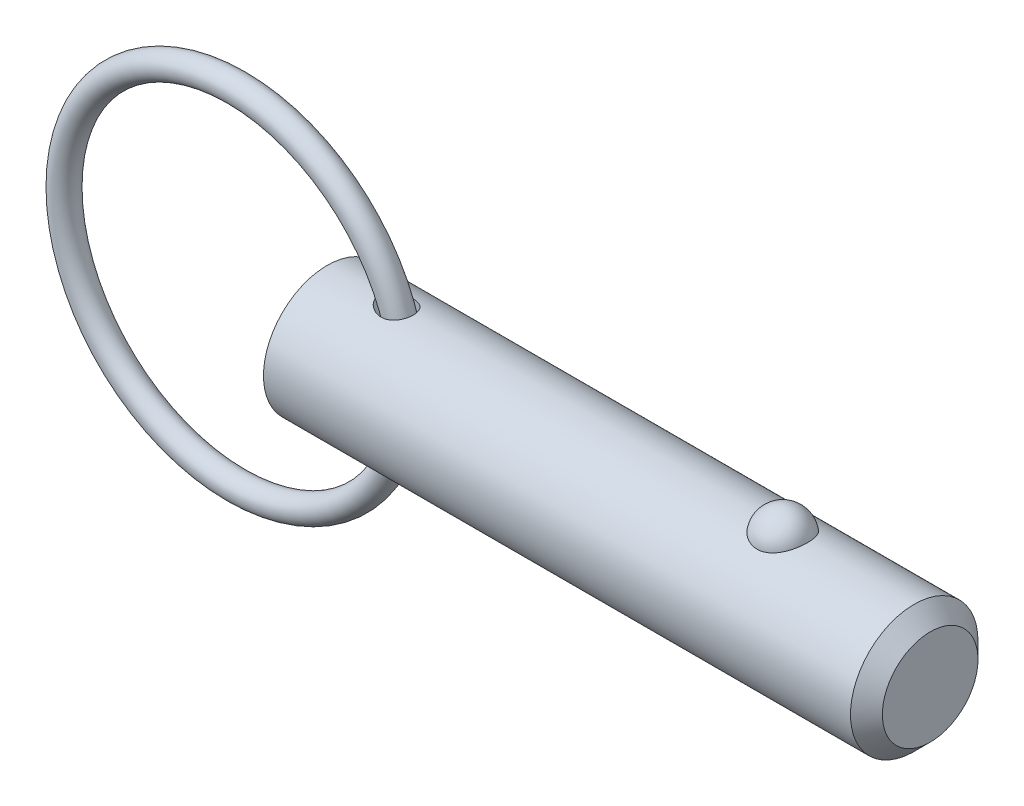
ISO-10303-21;
HEADER;
FILE_DESCRIPTION(('STEP AP214'),'2;1');
FILE_NAME('part.step','',(''),(''),'','','');
FILE_SCHEMA(('AUTOMOTIVE_DESIGN { 1 0 10303 214 1 1 1 1 }'));
ENDSEC;
DATA;
#1=APPLICATION_CONTEXT('core data for automotive mechanical design processes');
#2=APPLICATION_PROTOCOL_DEFINITION('international standard','automotive_design',2000,#1);
#3=PRODUCT_CONTEXT('',#1,'mechanical');
#4=PRODUCT('Part','Part','',(#3));
#5=PRODUCT_RELATED_PRODUCT_CATEGORY('part','',(#4));
#6=PRODUCT_DEFINITION_FORMATION('','',#4);
#7=PRODUCT_DEFINITION_CONTEXT('part definition',#1,'design');
#8=PRODUCT_DEFINITION('design','',#6,#7);
#9=PRODUCT_DEFINITION_SHAPE('','',#8);
#10=(LENGTH_UNIT() NAMED_UNIT(*) SI_UNIT(.MILLI.,.METRE.));
#11=(NAMED_UNIT(*) PLANE_ANGLE_UNIT() SI_UNIT($,.RADIAN.));
#12=(NAMED_UNIT(*) SI_UNIT($,.STERADIAN.) SOLID_ANGLE_UNIT());
#13=UNCERTAINTY_MEASURE_WITH_UNIT(LENGTH_MEASURE(1.E-05),#10,'distance_accuracy_value','');
#14=(GEOMETRIC_REPRESENTATION_CONTEXT(3) GLOBAL_UNCERTAINTY_ASSIGNED_CONTEXT((#13)) GLOBAL_UNIT_ASSIGNED_CONTEXT((#10,
#11,#12)) REPRESENTATION_CONTEXT('',''));
#15=CARTESIAN_POINT('',(0.,0.,0.));
#16=DIRECTION('',(0.,0.,1.));
#17=DIRECTION('',(1.,0.,0.));
#18=AXIS2_PLACEMENT_3D('',#15,#16,#17);
#19=CARTESIAN_POINT('',(-6.70471658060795,0.,0.));
#20=DIRECTION('',(0.,0.,1.));
#21=DIRECTION('',(1.,0.,0.));
#22=AXIS2_PLACEMENT_3D('',#19,#20,#21);
#23=TOROIDAL_SURFACE('',#22,12.7,0.940000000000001);
#24=CARTESIAN_POINT('',(6.93528341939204,0.,0.));
#25=VERTEX_POINT('',#24);
#26=VERTEX_LOOP('',#25);
#27=FACE_BOUND('',#26,.T.);
#28=ADVANCED_FACE('P0_F12',(#27),#23,.T.);
#29=CLOSED_SHELL('',(#28));
#30=MANIFOLD_SOLID_BREP('P0_B1',#29);
#31=CARTESIAN_POINT('',(0.,0.,0.));
#32=DIRECTION('',(1.,0.,0.));
#33=DIRECTION('',(0.,0.,-1.));
#34=AXIS2_PLACEMENT_3D('',#31,#32,#33);
#35=CYLINDRICAL_SURFACE('',#34,4.7);
#36=CARTESIAN_POINT('',(4.16378072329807,4.63584137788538,-0.773934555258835));
#37=CARTESIAN_POINT('',(4.22041228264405,4.62659903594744,-0.829297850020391));
#38=CARTESIAN_POINT('',(4.28206987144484,4.61719767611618,-0.879522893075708));
#39=CARTESIAN_POINT('',(4.4130315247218,4.59925351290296,-0.968997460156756));
#40=CARTESIAN_POINT('',(4.48234424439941,4.59071170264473,-1.00823437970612));
#41=CARTESIAN_POINT('',(4.62650734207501,4.5755493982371,-1.07495006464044));
#42=CARTESIAN_POINT('',(4.70135029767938,4.56892638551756,-1.10244426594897));
#43=CARTESIAN_POINT('',(4.85470490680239,4.55848940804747,-1.14483874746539));
#44=CARTESIAN_POINT('',(4.93321503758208,4.55467428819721,-1.15974420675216));
#45=CARTESIAN_POINT('',(5.09197970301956,4.55051176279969,-1.17597559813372));
#46=CARTESIAN_POINT('',(5.17223836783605,4.55017372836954,-1.17726483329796));
#47=CARTESIAN_POINT('',(5.33159446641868,4.55326696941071,-1.16524823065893));
#48=CARTESIAN_POINT('',(5.41069268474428,4.55669556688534,-1.15195276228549));
#49=CARTESIAN_POINT('',(5.55698758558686,4.56647801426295,-1.11249214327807));
#50=CARTESIAN_POINT('',(5.62458628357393,4.57250771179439,-1.08773548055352));
#51=CARTESIAN_POINT('',(5.75397700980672,4.58665356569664,-1.02644632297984));
#52=CARTESIAN_POINT('',(5.81577171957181,4.59476875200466,-0.989919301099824));
#53=CARTESIAN_POINT('',(5.92681484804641,4.61135052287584,-0.909391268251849));
#54=CARTESIAN_POINT('',(5.9766679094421,4.61973919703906,-0.866204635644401));
#55=CARTESIAN_POINT('',(6.0681785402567,4.63643253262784,-0.771868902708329));
#56=CARTESIAN_POINT('',(6.10983710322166,4.64473720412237,-0.72072076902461));
#57=CARTESIAN_POINT('',(6.18318089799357,4.660174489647,-0.612928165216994));
#58=CARTESIAN_POINT('',(6.21503150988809,4.66732544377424,-0.556398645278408));
#59=CARTESIAN_POINT('',(6.26900210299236,4.67985590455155,-0.438689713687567));
#60=CARTESIAN_POINT('',(6.29112194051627,4.68523538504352,-0.377510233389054));
#61=CARTESIAN_POINT('',(6.32523846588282,4.6936733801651,-0.251831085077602));
#62=CARTESIAN_POINT('',(6.33717189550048,4.69671737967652,-0.187313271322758));
#63=CARTESIAN_POINT('',(6.35042407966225,4.70010386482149,-0.0571258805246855));
#64=CARTESIAN_POINT('',(6.35174249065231,4.70044626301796,0.0085437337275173));
#65=CARTESIAN_POINT('',(6.34371729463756,4.69838816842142,0.139481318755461));
#66=CARTESIAN_POINT('',(6.33432596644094,4.69597539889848,0.204746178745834));
#67=CARTESIAN_POINT('',(6.30500866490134,4.68864655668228,0.332720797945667));
#68=CARTESIAN_POINT('',(6.28508259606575,4.68373046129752,0.395430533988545));
#69=CARTESIAN_POINT('',(6.23516511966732,4.67193431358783,0.516455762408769));
#70=CARTESIAN_POINT('',(6.20518126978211,4.66505573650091,0.574774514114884));
#71=CARTESIAN_POINT('',(6.13586314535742,4.65009270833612,0.685387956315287));
#72=CARTESIAN_POINT('',(6.09652950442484,4.64200833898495,0.737683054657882));
#73=CARTESIAN_POINT('',(6.00979078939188,4.62559001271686,0.834455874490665));
#74=CARTESIAN_POINT('',(5.96243625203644,4.61725787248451,0.878979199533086));
#75=CARTESIAN_POINT('',(5.86079843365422,4.60122574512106,0.959378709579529));
#76=CARTESIAN_POINT('',(5.80651591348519,4.59352568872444,0.9952558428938));
#77=CARTESIAN_POINT('',(5.69277386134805,4.57961669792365,1.05741527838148));
#78=CARTESIAN_POINT('',(5.63333134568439,4.57340309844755,1.08372773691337));
#79=CARTESIAN_POINT('',(5.51084249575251,4.56305640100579,1.12650026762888));
#80=CARTESIAN_POINT('',(5.44779577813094,4.55892352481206,1.14295928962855));
#81=CARTESIAN_POINT('',(5.31795668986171,4.55299444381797,1.1663590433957));
#82=CARTESIAN_POINT('',(5.25110869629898,4.55127026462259,1.17300670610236));
#83=CARTESIAN_POINT('',(5.1171681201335,4.55043953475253,1.17622268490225));
#84=CARTESIAN_POINT('',(5.05007546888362,4.55133378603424,1.17278791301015));
#85=CARTESIAN_POINT('',(4.91166083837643,4.55569951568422,1.15571913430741));
#86=CARTESIAN_POINT('',(4.8404469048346,4.55937764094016,1.1412666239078));
#87=CARTESIAN_POINT('',(4.70108819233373,4.56903562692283,1.10196123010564));
#88=CARTESIAN_POINT('',(4.63294574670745,4.57501720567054,1.07710058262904));
#89=CARTESIAN_POINT('',(4.49477300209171,4.58927184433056,1.01474439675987));
#90=CARTESIAN_POINT('',(4.42520748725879,4.59771156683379,0.976252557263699));
#91=CARTESIAN_POINT('',(4.29354165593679,4.61552030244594,0.888246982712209));
#92=CARTESIAN_POINT('',(4.23143936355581,4.62488906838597,0.83873617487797));
#93=CARTESIAN_POINT('',(4.12609666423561,4.64192969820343,0.738015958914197));
#94=CARTESIAN_POINT('',(4.08142630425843,4.64963595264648,0.688308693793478));
#95=CARTESIAN_POINT('',(4.00081170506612,4.66411457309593,0.582144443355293));
#96=CARTESIAN_POINT('',(3.96485623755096,4.6708881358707,0.525696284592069));
#97=CARTESIAN_POINT('',(3.90818393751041,4.68183565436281,0.415917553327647));
#98=CARTESIAN_POINT('',(3.88599581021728,4.68624644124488,0.363372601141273));
#99=CARTESIAN_POINT('',(3.85055971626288,4.693376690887,0.25523059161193));
#100=CARTESIAN_POINT('',(3.83730635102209,4.69609717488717,0.199635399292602));
#101=CARTESIAN_POINT('',(3.82058225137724,4.69954043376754,0.0867104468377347));
#102=CARTESIAN_POINT('',(3.81714632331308,4.70025610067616,0.0293752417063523));
#103=CARTESIAN_POINT('',(3.82041409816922,4.69957935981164,-0.0849928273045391));
#104=CARTESIAN_POINT('',(3.82711802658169,4.69818690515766,-0.142025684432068));
#105=CARTESIAN_POINT('',(3.84950128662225,4.69360426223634,-0.250744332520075));
#106=CARTESIAN_POINT('',(3.86463891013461,4.69052274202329,-0.302548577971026));
#107=CARTESIAN_POINT('',(3.9026119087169,4.68295207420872,-0.403121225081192));
#108=CARTESIAN_POINT('',(3.92544863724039,4.67846267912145,-0.451889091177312));
#109=CARTESIAN_POINT('',(3.97999306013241,4.6680441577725,-0.549522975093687));
#110=CARTESIAN_POINT('',(4.01228648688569,4.66202553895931,-0.598050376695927));
#111=CARTESIAN_POINT('',(4.08340845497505,4.64931397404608,-0.689954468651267));
#112=CARTESIAN_POINT('',(4.12224260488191,4.64262045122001,-0.733326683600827));
#113=CARTESIAN_POINT('',(4.16378072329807,4.63584137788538,-0.773934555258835));
#114=B_SPLINE_CURVE_WITH_KNOTS('',3,(#36,#37,#38,#39,#40,#41,#42,#43,#44,#45,#46,#47,#48,#49,
#50,#51,#52,#53,#54,#55,#56,#57,#58,#59,#60,#61,#62,#63,#64,#65,#66,#67,#68,#69,#70,#71,#72,#73,
#74,#75,#76,#77,#78,#79,#80,#81,#82,#83,#84,#85,#86,#87,#88,#89,#90,#91,#92,#93,#94,#95,#96,#97,
#98,#99,#100,#101,#102,#103,#104,#105,#106,#107,#108,#109,#110,#111,#112,#113),.UNSPECIFIED.,
.T.,.F.,(4,2,2,2,2,2,2,2,2,2,2,2,2,2,2,2,2,2,2,2,2,2,2,2,2,2,2,2,2,2,2,2,2,2,2,2,2,2,4),(0.,
0.238977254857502,0.478227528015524,0.717162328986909,0.95599878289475,1.19547875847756,
1.43478857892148,1.65034375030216,1.86579883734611,2.06429861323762,2.26277430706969,
2.45769248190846,2.65261353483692,2.848736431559,3.04486567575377,3.24187227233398,
3.43888065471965,3.63574133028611,3.83258866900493,4.0282389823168,4.22386782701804,
4.41887441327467,4.61390177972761,4.81464443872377,5.0154485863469,5.23282834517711,
5.45037055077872,5.68914354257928,5.92785317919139,6.12887730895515,6.32964104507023,
6.50053592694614,6.67132745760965,6.84272375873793,7.0141238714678,7.17560768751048,
7.33711990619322,7.5122540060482,7.68753905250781),.UNSPECIFIED.);
#115=CARTESIAN_POINT('',(4.16378072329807,4.63584137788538,-0.773934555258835));
#116=VERTEX_POINT('',#115);
#117=EDGE_CURVE('P1_E40',#116,#116,#114,.T.);
#118=ORIENTED_EDGE('',*,*,#117,.T.);
#119=EDGE_LOOP('',(#118));
#120=FACE_BOUND('',#119,.T.);
#121=CARTESIAN_POINT('',(43.275,0.,0.));
#122=DIRECTION('',(1.,0.,0.));
#123=DIRECTION('',(0.,0.,-1.));
#124=AXIS2_PLACEMENT_3D('',#121,#122,#123);
#125=CIRCLE('',#124,4.7);
#126=CARTESIAN_POINT('',(43.275,0.,-4.7));
#127=VERTEX_POINT('',#126);
#128=EDGE_CURVE('P1_E25',#127,#127,#125,.T.);
#129=ORIENTED_EDGE('',*,*,#128,.F.);
#130=EDGE_LOOP('',(#129));
#131=FACE_BOUND('',#130,.T.);
#132=CARTESIAN_POINT('',(0.,0.,0.));
#133=DIRECTION('',(1.,0.,0.));
#134=DIRECTION('',(0.,0.,-1.));
#135=AXIS2_PLACEMENT_3D('',#132,#133,#134);
#136=CIRCLE('',#135,4.7);
#137=CARTESIAN_POINT('',(0.,0.,-4.7));
#138=VERTEX_POINT('',#137);
#139=EDGE_CURVE('P1_E9',#138,#138,#136,.T.);
#140=ORIENTED_EDGE('',*,*,#139,.T.);
#141=EDGE_LOOP('',(#140));
#142=FACE_BOUND('',#141,.T.);
#143=CARTESIAN_POINT('',(33.5806283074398,4.30387706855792,1.88855557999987));
#144=CARTESIAN_POINT('',(33.4828134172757,4.30388592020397,1.88854684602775));
#145=CARTESIAN_POINT('',(33.3848511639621,4.30731231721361,1.88078712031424));
#146=CARTESIAN_POINT('',(33.191662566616,4.32065009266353,1.84993192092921));
#147=CARTESIAN_POINT('',(33.0964438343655,4.33057798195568,1.82679740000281));
#148=CARTESIAN_POINT('',(32.9118175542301,4.3557457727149,1.76594245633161));
#149=CARTESIAN_POINT('',(32.8223953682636,4.37097162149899,1.7282605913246));
#150=CARTESIAN_POINT('',(32.6513907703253,4.4050778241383,1.6393730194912));
#151=CARTESIAN_POINT('',(32.569805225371,4.4239567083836,1.58817274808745));
#152=CARTESIAN_POINT('',(32.4139011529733,4.46404088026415,1.47181116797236));
#153=CARTESIAN_POINT('',(32.3398759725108,4.48529915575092,1.40627540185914));
#154=CARTESIAN_POINT('',(32.2035361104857,4.527485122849,1.26387806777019));
#155=CARTESIAN_POINT('',(32.1412249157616,4.54841271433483,1.18701313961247));
#156=CARTESIAN_POINT('',(32.0270723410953,4.58876216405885,1.02025841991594));
#157=CARTESIAN_POINT('',(31.9758113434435,4.60807744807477,0.929944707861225));
#158=CARTESIAN_POINT('',(31.8884245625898,4.6421320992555,0.741468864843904));
#159=CARTESIAN_POINT('',(31.8522995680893,4.65687122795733,0.643306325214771));
#160=CARTESIAN_POINT('',(31.7956718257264,4.68038485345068,0.440967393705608));
#161=CARTESIAN_POINT('',(31.7753048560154,4.68910744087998,0.336746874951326));
#162=CARTESIAN_POINT('',(31.7511323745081,4.69949255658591,0.126059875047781));
#163=CARTESIAN_POINT('',(31.7473260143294,4.70115544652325,0.0195935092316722));
#164=CARTESIAN_POINT('',(31.7563081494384,4.69727256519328,-0.191500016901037));
#165=CARTESIAN_POINT('',(31.7689415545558,4.69179416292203,-0.296135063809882));
#166=CARTESIAN_POINT('',(31.8102760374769,4.67429351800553,-0.501612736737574));
#167=CARTESIAN_POINT('',(31.8389773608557,4.66227117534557,-0.602455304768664));
#168=CARTESIAN_POINT('',(31.9119285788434,4.63286427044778,-0.797707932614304));
#169=CARTESIAN_POINT('',(31.9562044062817,4.61547077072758,-0.892106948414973));
#170=CARTESIAN_POINT('',(32.0594074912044,4.57709900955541,-1.07173134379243));
#171=CARTESIAN_POINT('',(32.1183362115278,4.55612039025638,-1.15695580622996));
#172=CARTESIAN_POINT('',(32.2502161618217,4.51257918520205,-1.31664252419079));
#173=CARTESIAN_POINT('',(32.3232867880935,4.49000423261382,-1.39100294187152));
#174=CARTESIAN_POINT('',(32.4814784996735,4.44594443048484,-1.52598548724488));
#175=CARTESIAN_POINT('',(32.5665990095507,4.42445952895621,-1.58660827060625));
#176=CARTESIAN_POINT('',(32.7452673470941,4.38543655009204,-1.69145998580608));
#177=CARTESIAN_POINT('',(32.8386518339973,4.36783887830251,-1.73594433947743));
#178=CARTESIAN_POINT('',(33.0324220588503,4.3382941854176,-1.80852276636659));
#179=CARTESIAN_POINT('',(33.1328051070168,4.32634500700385,-1.83662309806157));
#180=CARTESIAN_POINT('',(33.3322875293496,4.31005085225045,-1.87453136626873));
#181=CARTESIAN_POINT('',(33.4311967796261,4.30535309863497,-1.88518956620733));
#182=CARTESIAN_POINT('',(33.6295210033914,4.30299844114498,-1.89055986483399));
#183=CARTESIAN_POINT('',(33.7289358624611,4.30534000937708,-1.88527542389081));
#184=CARTESIAN_POINT('',(33.9218638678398,4.31657737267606,-1.85939299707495));
#185=CARTESIAN_POINT('',(34.0154624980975,4.32524571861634,-1.83932621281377));
#186=CARTESIAN_POINT('',(34.1977839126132,4.34791518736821,-1.7850744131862));
#187=CARTESIAN_POINT('',(34.2865063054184,4.36191673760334,-1.75088826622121));
#188=CARTESIAN_POINT('',(34.458694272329,4.39411605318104,-1.66845234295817));
#189=CARTESIAN_POINT('',(34.5420089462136,4.41239631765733,-1.61992036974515));
#190=CARTESIAN_POINT('',(34.699399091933,4.45109244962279,-1.51034589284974));
#191=CARTESIAN_POINT('',(34.7734723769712,4.47150882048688,-1.44930043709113));
#192=CARTESIAN_POINT('',(34.9144058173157,4.51353865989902,-1.31275193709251));
#193=CARTESIAN_POINT('',(34.9807014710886,4.53515983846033,-1.23666813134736));
#194=CARTESIAN_POINT('',(35.1000698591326,4.57635116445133,-1.07425533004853));
#195=CARTESIAN_POINT('',(35.1531402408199,4.59592094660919,-0.987924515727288));
#196=CARTESIAN_POINT('',(35.2464438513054,4.63161819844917,-0.804428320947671));
#197=CARTESIAN_POINT('',(35.2862298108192,4.64762063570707,-0.707010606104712));
#198=CARTESIAN_POINT('',(35.3498257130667,4.67374032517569,-0.50634418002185));
#199=CARTESIAN_POINT('',(35.3736358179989,4.68385763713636,-0.403095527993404));
#200=CARTESIAN_POINT('',(35.4047510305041,4.69716075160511,-0.193975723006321));
#201=CARTESIAN_POINT('',(35.4120987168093,4.70036443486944,-0.0881120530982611));
#202=CARTESIAN_POINT('',(35.4102611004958,4.6995691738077,0.123441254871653));
#203=CARTESIAN_POINT('',(35.4010764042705,4.69557049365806,0.229130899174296));
#204=CARTESIAN_POINT('',(35.3664922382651,4.68082941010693,0.436545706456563));
#205=CARTESIAN_POINT('',(35.341209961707,4.67013575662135,0.538293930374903));
#206=CARTESIAN_POINT('',(35.275050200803,4.64311776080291,0.735797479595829));
#207=CARTESIAN_POINT('',(35.234171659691,4.62679303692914,0.831552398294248));
#208=CARTESIAN_POINT('',(35.1372869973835,4.59002712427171,1.01512750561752));
#209=CARTESIAN_POINT('',(35.0811735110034,4.56955699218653,1.10288523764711));
#210=CARTESIAN_POINT('',(34.9551085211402,4.52671789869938,1.26730106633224));
#211=CARTESIAN_POINT('',(34.8851572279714,4.50434896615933,1.34395933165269));
#212=CARTESIAN_POINT('',(34.7327247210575,4.46008413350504,1.48428028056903));
#213=CARTESIAN_POINT('',(34.6502095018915,4.43818970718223,1.54790656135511));
#214=CARTESIAN_POINT('',(34.4747358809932,4.39746476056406,1.66008504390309));
#215=CARTESIAN_POINT('',(34.3817736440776,4.37863537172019,1.70863168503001));
#216=CARTESIAN_POINT('',(34.1910997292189,4.34688784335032,1.78783023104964));
#217=CARTESIAN_POINT('',(34.0936298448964,4.33380220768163,1.81899757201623));
#218=CARTESIAN_POINT('',(33.8944052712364,4.31435159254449,1.86467392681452));
#219=CARTESIAN_POINT('',(33.7926639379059,4.30796708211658,1.87923136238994));
#220=CARTESIAN_POINT('',(33.6539136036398,4.3043503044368,1.8874737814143));
#221=CARTESIAN_POINT('',(33.6172813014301,4.30387375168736,1.8885588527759));
#222=CARTESIAN_POINT('',(33.5806283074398,4.30387706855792,1.88855557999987));
#223=B_SPLINE_CURVE_WITH_KNOTS('',3,(#143,#144,#145,#146,#147,#148,#149,#150,#151,#152,#153,
#154,#155,#156,#157,#158,#159,#160,#161,#162,#163,#164,#165,#166,#167,#168,#169,#170,#171,#172,
#173,#174,#175,#176,#177,#178,#179,#180,#181,#182,#183,#184,#185,#186,#187,#188,#189,#190,#191,
#192,#193,#194,#195,#196,#197,#198,#199,#200,#201,#202,#203,#204,#205,#206,#207,#208,#209,#210,
#211,#212,#213,#214,#215,#216,#217,#218,#219,#220,#221,#222),.UNSPECIFIED.,.T.,.F.,(4,2,2,2,2,2,
2,2,2,2,2,2,2,2,2,2,2,2,2,2,2,2,2,2,2,2,2,2,2,2,2,2,2,2,2,2,2,2,2,4),(0.,0.293339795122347,
0.587427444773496,0.88074090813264,1.17393661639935,1.47597417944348,1.77810150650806,
2.0935049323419,2.40892479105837,2.72703308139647,3.0451250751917,3.36023788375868,
3.67535550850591,3.9910003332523,4.30667668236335,4.62514463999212,4.94359739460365,
5.25676407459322,5.56981105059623,5.86708641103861,6.16429725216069,6.4513188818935,
6.73836351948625,7.03148013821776,7.3246659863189,7.63288296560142,7.94115473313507,
8.25895074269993,8.57674352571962,8.89371340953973,9.21067166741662,9.52534839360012,
9.84004644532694,10.157022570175,10.4739938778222,10.7918388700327,11.1098009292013,
11.4177488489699,11.7247967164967,11.834716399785),.UNSPECIFIED.);
#224=CARTESIAN_POINT('',(33.5806283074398,4.30387706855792,1.88855557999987));
#225=VERTEX_POINT('',#224);
#226=EDGE_CURVE('P1_E34',#225,#225,#223,.T.);
#227=ORIENTED_EDGE('',*,*,#226,.T.);
#228=EDGE_LOOP('',(#227));
#229=FACE_BOUND('',#228,.T.);
#230=CARTESIAN_POINT('',(4.16378072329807,-4.63584137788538,-0.773934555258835));
#231=CARTESIAN_POINT('',(4.11797605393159,-4.64331682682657,-0.729154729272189));
#232=CARTESIAN_POINT('',(4.07545237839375,-4.65068929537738,-0.681007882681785));
#233=CARTESIAN_POINT('',(3.99850919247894,-4.66454993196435,-0.578483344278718));
#234=CARTESIAN_POINT('',(3.96408464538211,-4.67103864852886,-0.524109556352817));
#235=CARTESIAN_POINT('',(3.90486465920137,-4.68247538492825,-0.409579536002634));
#236=CARTESIAN_POINT('',(3.8801478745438,-4.68741075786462,-0.349380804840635));
#237=CARTESIAN_POINT('',(3.84254060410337,-4.69500854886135,-0.225256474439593));
#238=CARTESIAN_POINT('',(3.82963753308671,-4.69767338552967,-0.161334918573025));
#239=CARTESIAN_POINT('',(3.81750619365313,-4.70018000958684,-0.039677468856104));
#240=CARTESIAN_POINT('',(3.81686237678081,-4.70031401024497,0.0179134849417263));
#241=CARTESIAN_POINT('',(3.8257005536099,-4.69848615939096,0.132270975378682));
#242=CARTESIAN_POINT('',(3.83518142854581,-4.6965245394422,0.189037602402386));
#243=CARTESIAN_POINT('',(3.86276707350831,-4.69091189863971,0.296808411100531));
#244=CARTESIAN_POINT('',(3.88034293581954,-4.68736483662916,0.347956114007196));
#245=CARTESIAN_POINT('',(3.92293217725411,-4.67896699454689,0.446919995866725));
#246=CARTESIAN_POINT('',(3.9479474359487,-4.67411588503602,0.49473532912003));
#247=CARTESIAN_POINT('',(4.00723361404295,-4.66297432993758,0.590975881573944));
#248=CARTESIAN_POINT('',(4.04218787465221,-4.65658759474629,0.638966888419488));
#249=CARTESIAN_POINT('',(4.11850165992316,-4.64327412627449,0.72945262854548));
#250=CARTESIAN_POINT('',(4.15986486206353,-4.63634708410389,0.77194418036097));
#251=CARTESIAN_POINT('',(4.25563139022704,-4.62124878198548,0.858077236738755));
#252=CARTESIAN_POINT('',(4.31104724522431,-4.61307408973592,0.90059363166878));
#253=CARTESIAN_POINT('',(4.42760239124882,-4.59748077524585,0.977085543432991));
#254=CARTESIAN_POINT('',(4.48874590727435,-4.59006271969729,1.01105468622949));
#255=CARTESIAN_POINT('',(4.62409915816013,-4.57577604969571,1.07399161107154));
#256=CARTESIAN_POINT('',(4.69895162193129,-4.56912175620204,1.10163764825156));
#257=CARTESIAN_POINT('',(4.8523861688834,-4.55861611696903,1.14433682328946));
#258=CARTESIAN_POINT('',(4.93096882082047,-4.55476520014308,1.15938803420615));
#259=CARTESIAN_POINT('',(5.0898384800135,-4.55053674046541,1.17587995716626));
#260=CARTESIAN_POINT('',(5.17012835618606,-4.55016559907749,1.17729558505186));
#261=CARTESIAN_POINT('',(5.329560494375,-4.55319561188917,1.16552635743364));
#262=CARTESIAN_POINT('',(5.40870366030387,-4.55659361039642,1.15235371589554));
#263=CARTESIAN_POINT('',(5.55512154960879,-4.56632591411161,1.11311448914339));
#264=CARTESIAN_POINT('',(5.62279525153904,-4.57233592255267,1.08845479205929));
#265=CARTESIAN_POINT('',(5.75235194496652,-4.58645252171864,1.02734156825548));
#266=CARTESIAN_POINT('',(5.81423750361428,-4.59455817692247,0.990893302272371));
#267=CARTESIAN_POINT('',(5.92544729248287,-4.61112960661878,0.91050755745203));
#268=CARTESIAN_POINT('',(5.97537756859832,-4.61951638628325,0.867388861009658));
#269=CARTESIAN_POINT('',(6.067050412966,-4.63621447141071,0.773173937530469));
#270=CARTESIAN_POINT('',(6.10879399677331,-4.64452578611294,0.722078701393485));
#271=CARTESIAN_POINT('',(6.18230323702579,-4.65998194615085,0.614385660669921));
#272=CARTESIAN_POINT('',(6.21423602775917,-4.66714520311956,0.557904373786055));
#273=CARTESIAN_POINT('',(6.26837651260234,-4.67970630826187,0.440277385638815));
#274=CARTESIAN_POINT('',(6.29058407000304,-4.68510413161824,0.37913161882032));
#275=CARTESIAN_POINT('',(6.32487950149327,-4.69358284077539,0.253506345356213));
#276=CARTESIAN_POINT('',(6.33690441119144,-4.69664929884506,0.189008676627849));
#277=CARTESIAN_POINT('',(6.35034148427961,-4.70008248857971,0.0588455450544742));
#278=CARTESIAN_POINT('',(6.35175330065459,-4.70044913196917,-0.00681995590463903));
#279=CARTESIAN_POINT('',(6.34391515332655,-4.69843881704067,-0.137767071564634));
#280=CARTESIAN_POINT('',(6.33461722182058,-4.69604951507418,-0.203045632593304));
#281=CARTESIAN_POINT('',(6.30548404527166,-4.68876413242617,-0.331063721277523));
#282=CARTESIAN_POINT('',(6.28564870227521,-4.68386802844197,-0.393803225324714));
#283=CARTESIAN_POINT('',(6.23590713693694,-4.67210599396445,-0.514904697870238));
#284=CARTESIAN_POINT('',(6.20600824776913,-4.66524149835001,-0.573269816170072));
#285=CARTESIAN_POINT('',(6.13685224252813,-4.65029918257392,-0.683989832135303));
#286=CARTESIAN_POINT('',(6.09759575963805,-4.6422214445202,-0.736345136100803));
#287=CARTESIAN_POINT('',(6.01099960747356,-4.62580793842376,-0.833250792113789));
#288=CARTESIAN_POINT('',(5.96371037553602,-4.61747403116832,-0.877846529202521));
#289=CARTESIAN_POINT('',(5.86219002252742,-4.60143050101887,-0.958399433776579));
#290=CARTESIAN_POINT('',(5.80795966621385,-4.59372080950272,-0.994357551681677));
#291=CARTESIAN_POINT('',(5.69431062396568,-4.57978661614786,-1.05668157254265));
#292=CARTESIAN_POINT('',(5.63490936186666,-4.57355737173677,-1.08307825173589));
#293=CARTESIAN_POINT('',(5.51248756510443,-4.56317492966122,-1.12602176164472));
#294=CARTESIAN_POINT('',(5.44946662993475,-4.55902196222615,-1.1425675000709));
#295=CARTESIAN_POINT('',(5.31967752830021,-4.55305083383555,-1.16613984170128));
#296=CARTESIAN_POINT('',(5.25285368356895,-4.55130415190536,-1.17287534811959));
#297=CARTESIAN_POINT('',(5.11894995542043,-4.55042807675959,-1.17626714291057));
#298=CARTESIAN_POINT('',(5.0518700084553,-4.55129938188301,-1.17292074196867));
#299=CARTESIAN_POINT('',(4.9134872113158,-4.55561850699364,-1.15603764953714));
#300=CARTESIAN_POINT('',(4.84229084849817,-4.55927235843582,-1.14168541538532));
#301=CARTESIAN_POINT('',(4.70293860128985,-4.56888540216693,-1.10258192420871));
#302=CARTESIAN_POINT('',(4.63478566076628,-4.57484677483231,-1.07782082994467));
#303=CARTESIAN_POINT('',(4.49401200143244,-4.58932889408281,-1.01452290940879));
#304=CARTESIAN_POINT('',(4.42204931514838,-4.59808779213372,-0.97456802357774));
#305=CARTESIAN_POINT('',(4.28620227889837,-4.61656806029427,-0.882881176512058));
#306=CARTESIAN_POINT('',(4.22231268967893,-4.62628879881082,-0.831156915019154));
#307=CARTESIAN_POINT('',(4.16378072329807,-4.63584137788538,-0.773934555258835));
#308=B_SPLINE_CURVE_WITH_KNOTS('',3,(#230,#231,#232,#233,#234,#235,#236,#237,#238,#239,#240,
#241,#242,#243,#244,#245,#246,#247,#248,#249,#250,#251,#252,#253,#254,#255,#256,#257,#258,#259,
#260,#261,#262,#263,#264,#265,#266,#267,#268,#269,#270,#271,#272,#273,#274,#275,#276,#277,#278,
#279,#280,#281,#282,#283,#284,#285,#286,#287,#288,#289,#290,#291,#292,#293,#294,#295,#296,#297,
#298,#299,#300,#301,#302,#303,#304,#305,#306,#307),.UNSPECIFIED.,.T.,.F.,(4,2,2,2,2,2,2,2,2,2,2,
2,2,2,2,2,2,2,2,2,2,2,2,2,2,2,2,2,2,2,2,2,2,2,2,2,2,2,4),(0.,0.19326332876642,0.386406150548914,
0.581083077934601,0.775552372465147,0.947410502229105,1.11924964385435,1.28117818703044,
1.44314767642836,1.62161944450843,1.80019400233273,2.01034324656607,2.22064874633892,
2.45975127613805,2.69889038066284,2.93846932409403,3.17784783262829,3.39350806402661,
3.60907218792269,3.80761226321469,4.00612769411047,4.20104508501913,4.39596521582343,
4.59208201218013,4.78820522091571,4.98521027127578,5.18221715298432,5.37908078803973,
5.57593110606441,5.7715882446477,5.96722384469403,6.1622240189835,6.35724581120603,
6.55794420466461,6.75869613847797,6.97596054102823,7.1934307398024,7.44055547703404,
7.68751900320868),.UNSPECIFIED.);
#309=CARTESIAN_POINT('',(4.16378072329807,-4.63584137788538,-0.773934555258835));
#310=VERTEX_POINT('',#309);
#311=EDGE_CURVE('P1_E17',#310,#310,#308,.T.);
#312=ORIENTED_EDGE('',*,*,#311,.T.);
#313=EDGE_LOOP('',(#312));
#314=FACE_BOUND('',#313,.T.);
#315=ADVANCED_FACE('P1_F13',(#120,#131,#142,#229,#314),#35,.T.);
#316=CARTESIAN_POINT('',(0.,0.,0.));
#317=DIRECTION('',(-1.,0.,0.));
#318=DIRECTION('',(0.,0.,1.));
#319=AXIS2_PLACEMENT_3D('',#316,#317,#318);
#320=PLANE('',#319);
#321=ORIENTED_EDGE('',*,*,#139,.F.);
#322=EDGE_LOOP('',(#321));
#323=FACE_BOUND('',#322,.T.);
#324=ADVANCED_FACE('P1_F15',(#323),#320,.T.);
#325=CARTESIAN_POINT('',(44.45,0.,0.));
#326=DIRECTION('',(-1.,0.,0.));
#327=DIRECTION('',(0.,0.,1.));
#328=AXIS2_PLACEMENT_3D('',#325,#326,#327);
#329=CONICAL_SURFACE('',#328,3.52500000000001,0.785398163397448);
#330=ORIENTED_EDGE('',*,*,#128,.T.);
#331=EDGE_LOOP('',(#330));
#332=FACE_BOUND('',#331,.T.);
#333=CARTESIAN_POINT('',(44.45,0.,0.));
#334=DIRECTION('',(1.,0.,0.));
#335=DIRECTION('',(0.,0.,-1.));
#336=AXIS2_PLACEMENT_3D('',#333,#334,#335);
#337=CIRCLE('',#336,3.52500000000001);
#338=CARTESIAN_POINT('',(44.45,0.,-3.52500000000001));
#339=VERTEX_POINT('',#338);
#340=EDGE_CURVE('P1_E30',#339,#339,#337,.T.);
#341=ORIENTED_EDGE('',*,*,#340,.F.);
#342=EDGE_LOOP('',(#341));
#343=FACE_BOUND('',#342,.T.);
#344=ADVANCED_FACE('P1_F55',(#332,#343),#329,.T.);
#345=CARTESIAN_POINT('',(44.45,3.52500000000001,0.));
#346=DIRECTION('',(1.,0.,0.));
#347=DIRECTION('',(0.,0.,-1.));
#348=AXIS2_PLACEMENT_3D('',#345,#346,#347);
#349=PLANE('',#348);
#350=ORIENTED_EDGE('',*,*,#340,.T.);
#351=EDGE_LOOP('',(#350));
#352=FACE_BOUND('',#351,.T.);
#353=ADVANCED_FACE('P1_F51',(#352),#349,.T.);
#354=CARTESIAN_POINT('',(33.5806283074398,4.23,0.));
#355=DIRECTION('',(-1.,0.,0.));
#356=DIRECTION('',(0.,1.,0.));
#357=AXIS2_PLACEMENT_3D('',#354,#355,#356);
#358=SPHERICAL_SURFACE('',#357,1.89);
#359=ORIENTED_EDGE('',*,*,#226,.F.);
#360=EDGE_LOOP('',(#359));
#361=FACE_BOUND('',#360,.T.);
#362=ADVANCED_FACE('P1_F46',(#361),#358,.T.);
#363=CARTESIAN_POINT('',(-6.70471658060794,0.,0.));
#364=DIRECTION('',(0.,0.,1.));
#365=DIRECTION('',(1.,0.,0.));
#366=AXIS2_PLACEMENT_3D('',#363,#364,#365);
#367=TOROIDAL_SURFACE('',#366,12.7,1.175);
#368=ORIENTED_EDGE('',*,*,#311,.F.);
#369=EDGE_LOOP('',(#368));
#370=FACE_BOUND('',#369,.T.);
#371=ORIENTED_EDGE('',*,*,#117,.F.);
#372=EDGE_LOOP('',(#371));
#373=FACE_BOUND('',#372,.T.);
#374=ADVANCED_FACE('P1_F50',(#370,#373),#367,.F.);
#375=CLOSED_SHELL('',(#315,#324,#344,#353,#362,#374));
#376=MANIFOLD_SOLID_BREP('P1_B1',#375);
#377=ADVANCED_BREP_SHAPE_REPRESENTATION('',(#18,#30,#376),#14);
#378=SHAPE_DEFINITION_REPRESENTATION(#9,#377);
ENDSEC;
END-ISO-10303-21;
